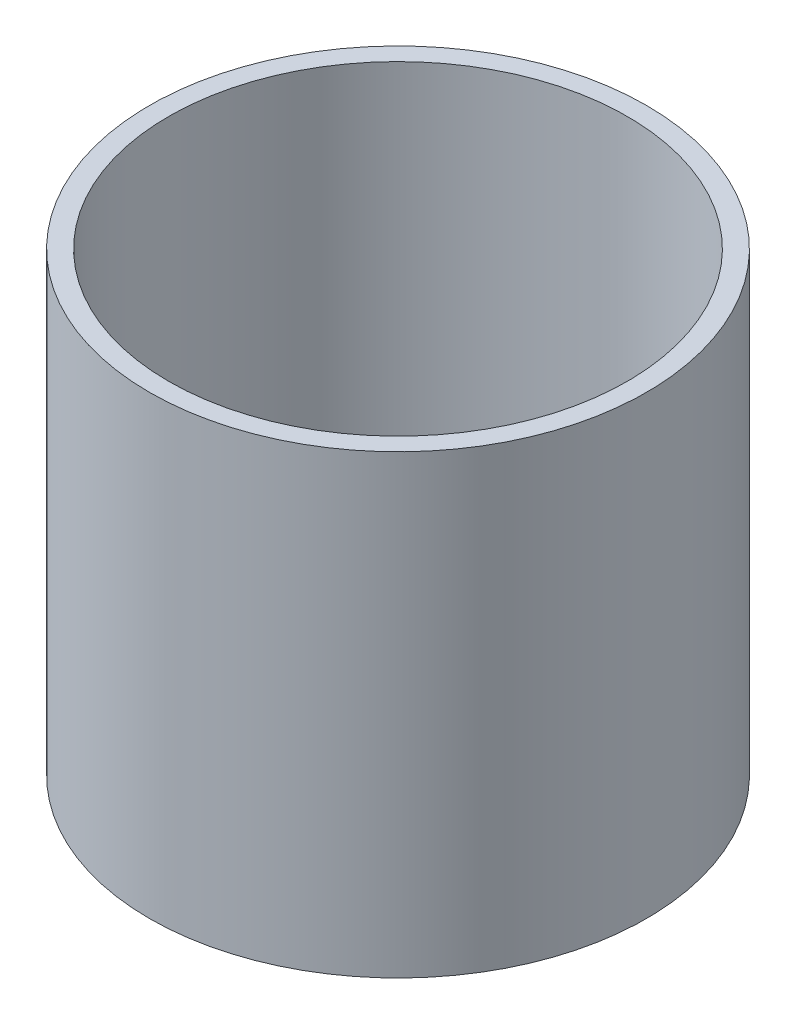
from build123d import *

# Parameters (mm, degrees)
SKETCH2_W = 6.35
SKETCH2_H = 151.3864


with BuildPart() as part:
    # Sketch2 → Base-Revolve (revolve)
    with BuildSketch(Plane.XY, mode=Mode.PRIVATE) as base_revolve_sk:
        with Locations((79.375, 0.0012)):
            Rectangle(SKETCH2_W, SKETCH2_H)
    revolve(base_revolve_sk.sketch.rotate(Axis((0, 85.852, 0), (0, -1, 0)), 90), axis=Axis((0, 85.852, 0), (0, -1, 0)))


solid = part.part
